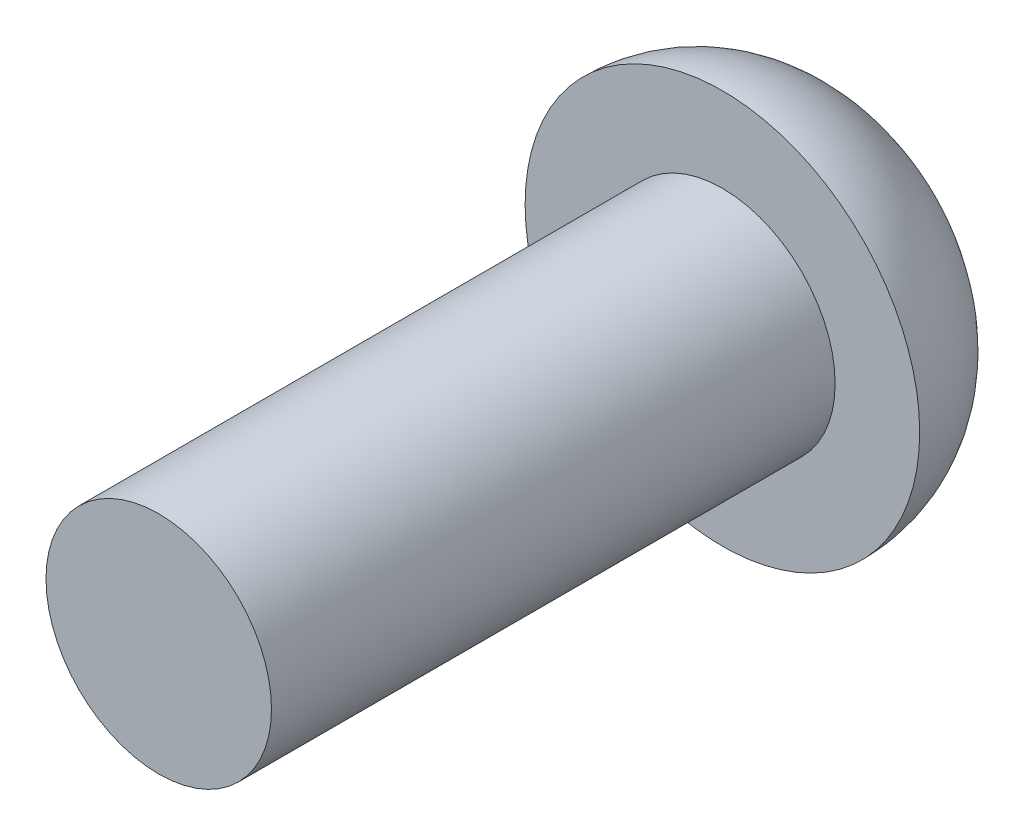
ISO-10303-21;
HEADER;
FILE_DESCRIPTION(('STEP AP214'),'2;1');
FILE_NAME('part.step','',(''),(''),'','','');
FILE_SCHEMA(('AUTOMOTIVE_DESIGN { 1 0 10303 214 1 1 1 1 }'));
ENDSEC;
DATA;
#1=APPLICATION_CONTEXT('core data for automotive mechanical design processes');
#2=APPLICATION_PROTOCOL_DEFINITION('international standard','automotive_design',2000,#1);
#3=PRODUCT_CONTEXT('',#1,'mechanical');
#4=PRODUCT('Part','Part','',(#3));
#5=PRODUCT_RELATED_PRODUCT_CATEGORY('part','',(#4));
#6=PRODUCT_DEFINITION_FORMATION('','',#4);
#7=PRODUCT_DEFINITION_CONTEXT('part definition',#1,'design');
#8=PRODUCT_DEFINITION('design','',#6,#7);
#9=PRODUCT_DEFINITION_SHAPE('','',#8);
#10=(LENGTH_UNIT() NAMED_UNIT(*) SI_UNIT(.MILLI.,.METRE.));
#11=(NAMED_UNIT(*) PLANE_ANGLE_UNIT() SI_UNIT($,.RADIAN.));
#12=(NAMED_UNIT(*) SI_UNIT($,.STERADIAN.) SOLID_ANGLE_UNIT());
#13=UNCERTAINTY_MEASURE_WITH_UNIT(LENGTH_MEASURE(1.E-05),#10,'distance_accuracy_value','');
#14=(GEOMETRIC_REPRESENTATION_CONTEXT(3) GLOBAL_UNCERTAINTY_ASSIGNED_CONTEXT((#13)) GLOBAL_UNIT_ASSIGNED_CONTEXT((#10,
#11,#12)) REPRESENTATION_CONTEXT('',''));
#15=CARTESIAN_POINT('',(0.,0.,0.));
#16=DIRECTION('',(0.,0.,1.));
#17=DIRECTION('',(1.,0.,0.));
#18=AXIS2_PLACEMENT_3D('',#15,#16,#17);
#19=CARTESIAN_POINT('',(0.,0.,5.));
#20=DIRECTION('',(0.,0.,1.));
#21=DIRECTION('',(1.,0.,0.));
#22=AXIS2_PLACEMENT_3D('',#19,#20,#21);
#23=PLANE('',#22);
#24=CARTESIAN_POINT('',(0.,0.,5.));
#25=DIRECTION('',(0.,0.,1.));
#26=DIRECTION('',(1.,0.,0.));
#27=AXIS2_PLACEMENT_3D('',#24,#25,#26);
#28=CIRCLE('',#27,7.);
#29=CARTESIAN_POINT('',(7.,0.,5.));
#30=VERTEX_POINT('',#29);
#31=EDGE_CURVE('E35',#30,#30,#28,.T.);
#32=ORIENTED_EDGE('',*,*,#31,.T.);
#33=EDGE_LOOP('',(#32));
#34=FACE_BOUND('',#33,.T.);
#35=CARTESIAN_POINT('',(0.,0.,5.));
#36=DIRECTION('',(0.,0.,1.));
#37=DIRECTION('',(1.,0.,0.));
#38=AXIS2_PLACEMENT_3D('',#35,#36,#37);
#39=CIRCLE('',#38,4.);
#40=CARTESIAN_POINT('',(4.,0.,5.));
#41=VERTEX_POINT('',#40);
#42=EDGE_CURVE('E43',#41,#41,#39,.T.);
#43=ORIENTED_EDGE('',*,*,#42,.F.);
#44=EDGE_LOOP('',(#43));
#45=FACE_BOUND('',#44,.T.);
#46=ADVANCED_FACE('F28',(#34,#45),#23,.T.);
#47=CARTESIAN_POINT('',(0.,0.,0.));
#48=DIRECTION('',(0.,0.,1.));
#49=DIRECTION('',(1.,0.,0.));
#50=AXIS2_PLACEMENT_3D('',#47,#48,#49);
#51=PLANE('',#50);
#52=CARTESIAN_POINT('',(0.,0.,0.));
#53=DIRECTION('',(0.,0.,1.));
#54=DIRECTION('',(1.,0.,0.));
#55=AXIS2_PLACEMENT_3D('',#52,#53,#54);
#56=CIRCLE('',#55,2.);
#57=CARTESIAN_POINT('',(2.,0.,0.));
#58=VERTEX_POINT('',#57);
#59=EDGE_CURVE('E10',#58,#58,#56,.F.);
#60=ORIENTED_EDGE('',*,*,#59,.T.);
#61=EDGE_LOOP('',(#60));
#62=FACE_BOUND('',#61,.T.);
#63=ADVANCED_FACE('F52',(#62),#51,.F.);
#64=CARTESIAN_POINT('',(0.,0.,25.));
#65=DIRECTION('',(0.,0.,-1.));
#66=DIRECTION('',(-1.,0.,0.));
#67=AXIS2_PLACEMENT_3D('',#64,#65,#66);
#68=CYLINDRICAL_SURFACE('',#67,4.);
#69=CARTESIAN_POINT('',(0.,0.,25.));
#70=DIRECTION('',(0.,0.,1.));
#71=DIRECTION('',(1.,0.,0.));
#72=AXIS2_PLACEMENT_3D('',#69,#70,#71);
#73=CIRCLE('',#72,4.);
#74=CARTESIAN_POINT('',(4.,0.,25.));
#75=VERTEX_POINT('',#74);
#76=EDGE_CURVE('E39',#75,#75,#73,.T.);
#77=ORIENTED_EDGE('',*,*,#76,.F.);
#78=EDGE_LOOP('',(#77));
#79=FACE_BOUND('',#78,.T.);
#80=ORIENTED_EDGE('',*,*,#42,.T.);
#81=EDGE_LOOP('',(#80));
#82=FACE_BOUND('',#81,.T.);
#83=ADVANCED_FACE('F49',(#79,#82),#68,.T.);
#84=CARTESIAN_POINT('',(0.,0.,25.));
#85=DIRECTION('',(0.,0.,1.));
#86=DIRECTION('',(1.,0.,0.));
#87=AXIS2_PLACEMENT_3D('',#84,#85,#86);
#88=PLANE('',#87);
#89=ORIENTED_EDGE('',*,*,#76,.T.);
#90=EDGE_LOOP('',(#89));
#91=FACE_BOUND('',#90,.T.);
#92=ADVANCED_FACE('F60',(#91),#88,.T.);
#93=CARTESIAN_POINT('',(0.,0.,5.));
#94=DIRECTION('',(0.,0.,1.));
#95=DIRECTION('',(1.,0.,0.));
#96=AXIS2_PLACEMENT_3D('',#93,#94,#95);
#97=DEGENERATE_TOROIDAL_SURFACE('',#96,2.,5.,.T.);
#98=ORIENTED_EDGE('',*,*,#59,.F.);
#99=EDGE_LOOP('',(#98));
#100=FACE_BOUND('',#99,.T.);
#101=ORIENTED_EDGE('',*,*,#31,.F.);
#102=EDGE_LOOP('',(#101));
#103=FACE_BOUND('',#102,.T.);
#104=ADVANCED_FACE('F30',(#100,#103),#97,.T.);
#105=CLOSED_SHELL('',(#46,#63,#83,#92,#104));
#106=MANIFOLD_SOLID_BREP('B2',#105);
#107=ADVANCED_BREP_SHAPE_REPRESENTATION('',(#18,#106),#14);
#108=SHAPE_DEFINITION_REPRESENTATION(#9,#107);
ENDSEC;
END-ISO-10303-21;
